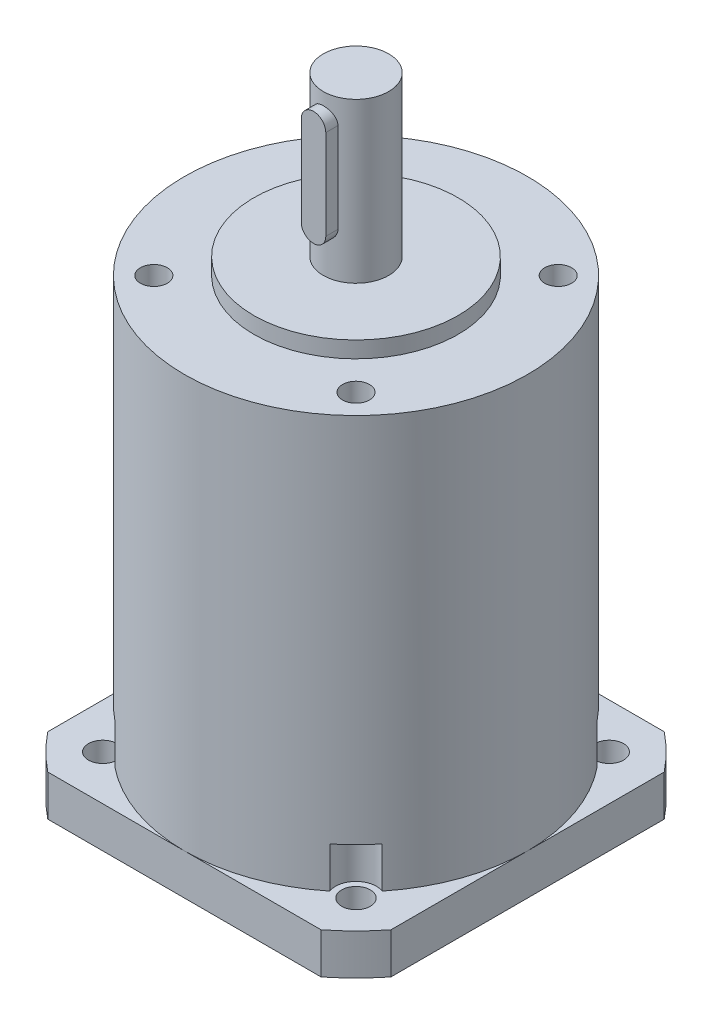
ISO-10303-21;
HEADER;
FILE_DESCRIPTION(('STEP AP214'),'2;1');
FILE_NAME('part.step','',(''),(''),'','','');
FILE_SCHEMA(('AUTOMOTIVE_DESIGN { 1 0 10303 214 1 1 1 1 }'));
ENDSEC;
DATA;
#1=APPLICATION_CONTEXT('core data for automotive mechanical design processes');
#2=APPLICATION_PROTOCOL_DEFINITION('international standard','automotive_design',2000,#1);
#3=PRODUCT_CONTEXT('',#1,'mechanical');
#4=PRODUCT('Part','Part','',(#3));
#5=PRODUCT_RELATED_PRODUCT_CATEGORY('part','',(#4));
#6=PRODUCT_DEFINITION_FORMATION('','',#4);
#7=PRODUCT_DEFINITION_CONTEXT('part definition',#1,'design');
#8=PRODUCT_DEFINITION('design','',#6,#7);
#9=PRODUCT_DEFINITION_SHAPE('','',#8);
#10=(LENGTH_UNIT() NAMED_UNIT(*) SI_UNIT(.MILLI.,.METRE.));
#11=(NAMED_UNIT(*) PLANE_ANGLE_UNIT() SI_UNIT($,.RADIAN.));
#12=(NAMED_UNIT(*) SI_UNIT($,.STERADIAN.) SOLID_ANGLE_UNIT());
#13=UNCERTAINTY_MEASURE_WITH_UNIT(LENGTH_MEASURE(1.E-05),#10,'distance_accuracy_value','');
#14=(GEOMETRIC_REPRESENTATION_CONTEXT(3) GLOBAL_UNCERTAINTY_ASSIGNED_CONTEXT((#13)) GLOBAL_UNIT_ASSIGNED_CONTEXT((#10,
#11,#12)) REPRESENTATION_CONTEXT('',''));
#15=CARTESIAN_POINT('',(0.,0.,0.));
#16=DIRECTION('',(0.,0.,1.));
#17=DIRECTION('',(1.,0.,0.));
#18=AXIS2_PLACEMENT_3D('',#15,#16,#17);
#19=CARTESIAN_POINT('',(0.,50.5,0.));
#20=DIRECTION('',(0.,-1.,0.));
#21=DIRECTION('',(0.,0.,-1.));
#22=AXIS2_PLACEMENT_3D('',#19,#20,#21);
#23=CYLINDRICAL_SURFACE('',#22,21.);
#24=CARTESIAN_POINT('',(0.,50.5,0.));
#25=DIRECTION('',(0.,1.,0.));
#26=DIRECTION('',(0.,0.,1.));
#27=AXIS2_PLACEMENT_3D('',#24,#25,#26);
#28=CIRCLE('',#27,21.);
#29=CARTESIAN_POINT('',(0.,50.5,21.));
#30=VERTEX_POINT('',#29);
#31=EDGE_CURVE('E235',#30,#30,#28,.T.);
#32=ORIENTED_EDGE('',*,*,#31,.F.);
#33=EDGE_LOOP('',(#32));
#34=FACE_BOUND('',#33,.T.);
#35=DIRECTION('',(0.,-1.,0.));
#36=VECTOR('',#35,1.);
#37=CARTESIAN_POINT('',(16.3684898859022,2.5,-13.1557036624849));
#38=LINE('',#37,#36);
#39=CARTESIAN_POINT('',(16.3684898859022,5.,-13.1557036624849));
#40=VERTEX_POINT('',#39);
#41=CARTESIAN_POINT('',(16.3684898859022,0.,-13.1557036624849));
#42=VERTEX_POINT('',#41);
#43=EDGE_CURVE('E199',#40,#42,#38,.T.);
#44=ORIENTED_EDGE('',*,*,#43,.F.);
#45=CARTESIAN_POINT('',(0.,5.,0.));
#46=DIRECTION('',(0.,-1.,0.));
#47=DIRECTION('',(0.,0.,-1.));
#48=AXIS2_PLACEMENT_3D('',#45,#46,#47);
#49=CIRCLE('',#48,21.);
#50=CARTESIAN_POINT('',(13.1557036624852,5.,-16.3684898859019));
#51=VERTEX_POINT('',#50);
#52=EDGE_CURVE('E314',#51,#40,#49,.T.);
#53=ORIENTED_EDGE('',*,*,#52,.F.);
#54=DIRECTION('',(0.,-1.,0.));
#55=VECTOR('',#54,1.);
#56=CARTESIAN_POINT('',(13.1557036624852,2.5,-16.3684898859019));
#57=LINE('',#56,#55);
#58=CARTESIAN_POINT('',(13.1557036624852,0.,-16.3684898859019));
#59=VERTEX_POINT('',#58);
#60=EDGE_CURVE('E210',#59,#51,#57,.F.);
#61=ORIENTED_EDGE('',*,*,#60,.F.);
#62=CARTESIAN_POINT('',(0.,0.,0.));
#63=DIRECTION('',(0.,1.,0.));
#64=DIRECTION('',(0.,0.,1.));
#65=AXIS2_PLACEMENT_3D('',#62,#63,#64);
#66=CIRCLE('',#65,21.);
#67=CARTESIAN_POINT('',(0.,0.,-21.));
#68=VERTEX_POINT('',#67);
#69=EDGE_CURVE('E220',#59,#68,#66,.T.);
#70=ORIENTED_EDGE('',*,*,#69,.T.);
#71=CARTESIAN_POINT('',(-13.155703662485,0.,-16.3684898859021));
#72=VERTEX_POINT('',#71);
#73=EDGE_CURVE('E228',#68,#72,#66,.T.);
#74=ORIENTED_EDGE('',*,*,#73,.T.);
#75=DIRECTION('',(0.,-1.,0.));
#76=VECTOR('',#75,1.);
#77=CARTESIAN_POINT('',(-13.155703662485,2.5,-16.3684898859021));
#78=LINE('',#77,#76);
#79=CARTESIAN_POINT('',(-13.155703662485,5.,-16.3684898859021));
#80=VERTEX_POINT('',#79);
#81=EDGE_CURVE('E606',#80,#72,#78,.T.);
#82=ORIENTED_EDGE('',*,*,#81,.F.);
#83=CARTESIAN_POINT('',(0.,5.,0.));
#84=DIRECTION('',(0.,-1.,0.));
#85=DIRECTION('',(0.,0.,-1.));
#86=AXIS2_PLACEMENT_3D('',#83,#84,#85);
#87=CIRCLE('',#86,21.);
#88=CARTESIAN_POINT('',(-16.3684898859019,5.,-13.1557036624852));
#89=VERTEX_POINT('',#88);
#90=EDGE_CURVE('E316',#89,#80,#87,.T.);
#91=ORIENTED_EDGE('',*,*,#90,.F.);
#92=DIRECTION('',(0.,-1.,0.));
#93=VECTOR('',#92,1.);
#94=CARTESIAN_POINT('',(-16.3684898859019,2.5,-13.1557036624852));
#95=LINE('',#94,#93);
#96=CARTESIAN_POINT('',(-16.3684898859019,0.,-13.1557036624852));
#97=VERTEX_POINT('',#96);
#98=EDGE_CURVE('E610',#97,#89,#95,.F.);
#99=ORIENTED_EDGE('',*,*,#98,.F.);
#100=CARTESIAN_POINT('',(-21.,0.,0.));
#101=VERTEX_POINT('',#100);
#102=EDGE_CURVE('E231',#97,#101,#66,.T.);
#103=ORIENTED_EDGE('',*,*,#102,.T.);
#104=CARTESIAN_POINT('',(-16.3684898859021,0.,13.155703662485));
#105=VERTEX_POINT('',#104);
#106=EDGE_CURVE('E229',#101,#105,#66,.T.);
#107=ORIENTED_EDGE('',*,*,#106,.T.);
#108=DIRECTION('',(0.,-1.,0.));
#109=VECTOR('',#108,1.);
#110=CARTESIAN_POINT('',(-16.3684898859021,2.5,13.155703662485));
#111=LINE('',#110,#109);
#112=CARTESIAN_POINT('',(-16.3684898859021,5.,13.155703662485));
#113=VERTEX_POINT('',#112);
#114=EDGE_CURVE('E331',#113,#105,#111,.T.);
#115=ORIENTED_EDGE('',*,*,#114,.F.);
#116=CARTESIAN_POINT('',(0.,5.,0.));
#117=DIRECTION('',(0.,-1.,0.));
#118=DIRECTION('',(0.,0.,-1.));
#119=AXIS2_PLACEMENT_3D('',#116,#117,#118);
#120=CIRCLE('',#119,21.);
#121=CARTESIAN_POINT('',(-13.1557036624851,5.,16.368489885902));
#122=VERTEX_POINT('',#121);
#123=EDGE_CURVE('E318',#122,#113,#120,.T.);
#124=ORIENTED_EDGE('',*,*,#123,.F.);
#125=DIRECTION('',(0.,-1.,0.));
#126=VECTOR('',#125,1.);
#127=CARTESIAN_POINT('',(-13.1557036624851,2.5,16.368489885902));
#128=LINE('',#127,#126);
#129=CARTESIAN_POINT('',(-13.1557036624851,0.,16.368489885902));
#130=VERTEX_POINT('',#129);
#131=EDGE_CURVE('E335',#130,#122,#128,.F.);
#132=ORIENTED_EDGE('',*,*,#131,.F.);
#133=CARTESIAN_POINT('',(0.,0.,21.));
#134=VERTEX_POINT('',#133);
#135=EDGE_CURVE('E230',#130,#134,#66,.T.);
#136=ORIENTED_EDGE('',*,*,#135,.T.);
#137=CARTESIAN_POINT('',(13.1557036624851,0.,16.368489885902));
#138=VERTEX_POINT('',#137);
#139=EDGE_CURVE('E227',#134,#138,#66,.T.);
#140=ORIENTED_EDGE('',*,*,#139,.T.);
#141=DIRECTION('',(0.,-1.,0.));
#142=VECTOR('',#141,1.);
#143=CARTESIAN_POINT('',(13.1557036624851,2.5,16.368489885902));
#144=LINE('',#143,#142);
#145=CARTESIAN_POINT('',(13.1557036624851,5.,16.368489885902));
#146=VERTEX_POINT('',#145);
#147=EDGE_CURVE('E46',#146,#138,#144,.T.);
#148=ORIENTED_EDGE('',*,*,#147,.F.);
#149=CARTESIAN_POINT('',(0.,5.,0.));
#150=DIRECTION('',(0.,-1.,0.));
#151=DIRECTION('',(0.,0.,-1.));
#152=AXIS2_PLACEMENT_3D('',#149,#150,#151);
#153=CIRCLE('',#152,21.);
#154=CARTESIAN_POINT('',(16.368489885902,5.,13.1557036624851));
#155=VERTEX_POINT('',#154);
#156=EDGE_CURVE('E307',#155,#146,#153,.T.);
#157=ORIENTED_EDGE('',*,*,#156,.F.);
#158=DIRECTION('',(0.,-1.,0.));
#159=VECTOR('',#158,1.);
#160=CARTESIAN_POINT('',(16.368489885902,2.5,13.1557036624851));
#161=LINE('',#160,#159);
#162=CARTESIAN_POINT('',(16.368489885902,0.,13.1557036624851));
#163=VERTEX_POINT('',#162);
#164=EDGE_CURVE('E11',#163,#155,#161,.F.);
#165=ORIENTED_EDGE('',*,*,#164,.F.);
#166=CARTESIAN_POINT('',(21.,0.,0.));
#167=VERTEX_POINT('',#166);
#168=EDGE_CURVE('E224',#163,#167,#66,.T.);
#169=ORIENTED_EDGE('',*,*,#168,.T.);
#170=EDGE_CURVE('E217',#167,#42,#66,.T.);
#171=ORIENTED_EDGE('',*,*,#170,.T.);
#172=EDGE_LOOP('',(#44,#53,#61,#70,#74,#82,#91,#99,#103,#107,#115,#124,#132,#136,#140,#148,#157,
#165,#169,#171));
#173=FACE_BOUND('',#172,.T.);
#174=ADVANCED_FACE('F39',(#34,#173),#23,.T.);
#175=CARTESIAN_POINT('',(15.4999999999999,5.,-15.5000000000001));
#176=DIRECTION('',(0.,-1.,0.));
#177=DIRECTION('',(0.,0.,-1.));
#178=AXIS2_PLACEMENT_3D('',#175,#176,#177);
#179=CYLINDRICAL_SURFACE('',#178,1.75);
#180=CARTESIAN_POINT('',(15.4999999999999,-5.,-15.5000000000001));
#181=DIRECTION('',(0.,-1.,0.));
#182=DIRECTION('',(0.,0.,-1.));
#183=AXIS2_PLACEMENT_3D('',#180,#181,#182);
#184=CIRCLE('',#183,1.75);
#185=CARTESIAN_POINT('',(15.4999999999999,-5.,-17.2500000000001));
#186=VERTEX_POINT('',#185);
#187=EDGE_CURVE('E349',#186,#186,#184,.T.);
#188=ORIENTED_EDGE('',*,*,#187,.T.);
#189=EDGE_LOOP('',(#188));
#190=FACE_BOUND('',#189,.T.);
#191=CARTESIAN_POINT('',(15.4999999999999,0.,-15.5000000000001));
#192=DIRECTION('',(0.,-1.,0.));
#193=DIRECTION('',(0.,0.,-1.));
#194=AXIS2_PLACEMENT_3D('',#191,#192,#193);
#195=CIRCLE('',#194,1.75);
#196=CARTESIAN_POINT('',(15.4999999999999,0.,-17.2500000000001));
#197=VERTEX_POINT('',#196);
#198=EDGE_CURVE('E352',#197,#197,#195,.T.);
#199=ORIENTED_EDGE('',*,*,#198,.F.);
#200=EDGE_LOOP('',(#199));
#201=FACE_BOUND('',#200,.T.);
#202=ADVANCED_FACE('F493',(#190,#201),#179,.F.);
#203=CARTESIAN_POINT('',(-15.5000000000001,5.,-15.4999999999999));
#204=DIRECTION('',(0.,-1.,0.));
#205=DIRECTION('',(0.,0.,-1.));
#206=AXIS2_PLACEMENT_3D('',#203,#204,#205);
#207=CYLINDRICAL_SURFACE('',#206,1.75);
#208=CARTESIAN_POINT('',(-15.5000000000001,-5.,-15.4999999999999));
#209=DIRECTION('',(0.,-1.,0.));
#210=DIRECTION('',(0.,0.,-1.));
#211=AXIS2_PLACEMENT_3D('',#208,#209,#210);
#212=CIRCLE('',#211,1.75);
#213=CARTESIAN_POINT('',(-15.5000000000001,-5.,-17.2499999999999));
#214=VERTEX_POINT('',#213);
#215=EDGE_CURVE('E343',#214,#214,#212,.T.);
#216=ORIENTED_EDGE('',*,*,#215,.T.);
#217=EDGE_LOOP('',(#216));
#218=FACE_BOUND('',#217,.T.);
#219=CARTESIAN_POINT('',(-15.5000000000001,0.,-15.4999999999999));
#220=DIRECTION('',(0.,-1.,0.));
#221=DIRECTION('',(0.,0.,-1.));
#222=AXIS2_PLACEMENT_3D('',#219,#220,#221);
#223=CIRCLE('',#222,1.75);
#224=CARTESIAN_POINT('',(-15.5000000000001,0.,-17.2499999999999));
#225=VERTEX_POINT('',#224);
#226=EDGE_CURVE('E346',#225,#225,#223,.T.);
#227=ORIENTED_EDGE('',*,*,#226,.F.);
#228=EDGE_LOOP('',(#227));
#229=FACE_BOUND('',#228,.T.);
#230=ADVANCED_FACE('F498',(#218,#229),#207,.F.);
#231=CARTESIAN_POINT('',(-15.4999999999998,5.,15.5000000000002));
#232=DIRECTION('',(0.,-1.,0.));
#233=DIRECTION('',(0.,0.,-1.));
#234=AXIS2_PLACEMENT_3D('',#231,#232,#233);
#235=CYLINDRICAL_SURFACE('',#234,1.75);
#236=CARTESIAN_POINT('',(-15.4999999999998,-5.,15.5000000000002));
#237=DIRECTION('',(0.,-1.,0.));
#238=DIRECTION('',(0.,0.,-1.));
#239=AXIS2_PLACEMENT_3D('',#236,#237,#238);
#240=CIRCLE('',#239,1.75);
#241=CARTESIAN_POINT('',(-15.4999999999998,-5.,13.7500000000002));
#242=VERTEX_POINT('',#241);
#243=EDGE_CURVE('E333',#242,#242,#240,.T.);
#244=ORIENTED_EDGE('',*,*,#243,.T.);
#245=EDGE_LOOP('',(#244));
#246=FACE_BOUND('',#245,.T.);
#247=CARTESIAN_POINT('',(-15.4999999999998,0.,15.5000000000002));
#248=DIRECTION('',(0.,-1.,0.));
#249=DIRECTION('',(0.,0.,-1.));
#250=AXIS2_PLACEMENT_3D('',#247,#248,#249);
#251=CIRCLE('',#250,1.75);
#252=CARTESIAN_POINT('',(-15.4999999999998,0.,13.7500000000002));
#253=VERTEX_POINT('',#252);
#254=EDGE_CURVE('E340',#253,#253,#251,.T.);
#255=ORIENTED_EDGE('',*,*,#254,.F.);
#256=EDGE_LOOP('',(#255));
#257=FACE_BOUND('',#256,.T.);
#258=ADVANCED_FACE('F504',(#246,#257),#235,.F.);
#259=CARTESIAN_POINT('',(15.5,5.,15.5));
#260=DIRECTION('',(0.,-1.,0.));
#261=DIRECTION('',(0.,0.,-1.));
#262=AXIS2_PLACEMENT_3D('',#259,#260,#261);
#263=CYLINDRICAL_SURFACE('',#262,1.75);
#264=CARTESIAN_POINT('',(15.5,-5.,15.5));
#265=DIRECTION('',(0.,-1.,0.));
#266=DIRECTION('',(0.,0.,-1.));
#267=AXIS2_PLACEMENT_3D('',#264,#265,#266);
#268=CIRCLE('',#267,1.75);
#269=CARTESIAN_POINT('',(15.5,-5.,13.75));
#270=VERTEX_POINT('',#269);
#271=EDGE_CURVE('E355',#270,#270,#268,.T.);
#272=ORIENTED_EDGE('',*,*,#271,.T.);
#273=EDGE_LOOP('',(#272));
#274=FACE_BOUND('',#273,.T.);
#275=CARTESIAN_POINT('',(15.5,0.,15.5));
#276=DIRECTION('',(0.,-1.,0.));
#277=DIRECTION('',(0.,0.,-1.));
#278=AXIS2_PLACEMENT_3D('',#275,#276,#277);
#279=CIRCLE('',#278,1.75);
#280=CARTESIAN_POINT('',(15.5,0.,13.75));
#281=VERTEX_POINT('',#280);
#282=EDGE_CURVE('E358',#281,#281,#279,.T.);
#283=ORIENTED_EDGE('',*,*,#282,.F.);
#284=EDGE_LOOP('',(#283));
#285=FACE_BOUND('',#284,.T.);
#286=ADVANCED_FACE('F516',(#274,#285),#263,.F.);
#287=CARTESIAN_POINT('',(0.,0.,0.));
#288=DIRECTION('',(0.,-1.,0.));
#289=DIRECTION('',(0.,0.,-1.));
#290=AXIS2_PLACEMENT_3D('',#287,#288,#289);
#291=PLANE('',#290);
#292=ORIENTED_EDGE('',*,*,#282,.T.);
#293=EDGE_LOOP('',(#292));
#294=FACE_BOUND('',#293,.T.);
#295=CARTESIAN_POINT('',(15.5,0.,15.5));
#296=DIRECTION('',(0.,1.,0.));
#297=DIRECTION('',(0.,0.,1.));
#298=AXIS2_PLACEMENT_3D('',#295,#296,#297);
#299=CIRCLE('',#298,2.5);
#300=EDGE_CURVE('E324',#163,#138,#299,.T.);
#301=ORIENTED_EDGE('',*,*,#300,.T.);
#302=ORIENTED_EDGE('',*,*,#139,.F.);
#303=DIRECTION('',(1.,0.,0.));
#304=VECTOR('',#303,1.);
#305=CARTESIAN_POINT('',(-21.,0.,21.));
#306=LINE('',#305,#304);
#307=CARTESIAN_POINT('',(16.7308846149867,0.,21.));
#308=VERTEX_POINT('',#307);
#309=EDGE_CURVE('E422',#134,#308,#306,.T.);
#310=ORIENTED_EDGE('',*,*,#309,.T.);
#311=CARTESIAN_POINT('',(0.,0.,0.));
#312=DIRECTION('',(0.,1.,0.));
#313=DIRECTION('',(0.,0.,1.));
#314=AXIS2_PLACEMENT_3D('',#311,#312,#313);
#315=CIRCLE('',#314,26.85);
#316=CARTESIAN_POINT('',(21.,0.,16.7308846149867));
#317=VERTEX_POINT('',#316);
#318=EDGE_CURVE('E369',#308,#317,#315,.T.);
#319=ORIENTED_EDGE('',*,*,#318,.T.);
#320=DIRECTION('',(0.,0.,-1.));
#321=VECTOR('',#320,1.);
#322=CARTESIAN_POINT('',(21.,0.,21.));
#323=LINE('',#322,#321);
#324=EDGE_CURVE('E413',#317,#167,#323,.T.);
#325=ORIENTED_EDGE('',*,*,#324,.T.);
#326=ORIENTED_EDGE('',*,*,#168,.F.);
#327=EDGE_LOOP('',(#301,#302,#310,#319,#325,#326));
#328=FACE_BOUND('',#327,.T.);
#329=ADVANCED_FACE('F329',(#294,#328),#291,.F.);
#330=ORIENTED_EDGE('',*,*,#198,.T.);
#331=EDGE_LOOP('',(#330));
#332=FACE_BOUND('',#331,.T.);
#333=CARTESIAN_POINT('',(15.5000000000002,0.,-15.4999999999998));
#334=DIRECTION('',(0.,1.,0.));
#335=DIRECTION('',(0.,0.,1.));
#336=AXIS2_PLACEMENT_3D('',#333,#334,#335);
#337=CIRCLE('',#336,2.5);
#338=EDGE_CURVE('E203',#59,#42,#337,.T.);
#339=ORIENTED_EDGE('',*,*,#338,.T.);
#340=ORIENTED_EDGE('',*,*,#170,.F.);
#341=CARTESIAN_POINT('',(21.,0.,-16.7308846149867));
#342=VERTEX_POINT('',#341);
#343=EDGE_CURVE('E398',#167,#342,#323,.T.);
#344=ORIENTED_EDGE('',*,*,#343,.T.);
#345=CARTESIAN_POINT('',(16.7308846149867,0.,-21.));
#346=VERTEX_POINT('',#345);
#347=EDGE_CURVE('E373',#342,#346,#315,.T.);
#348=ORIENTED_EDGE('',*,*,#347,.T.);
#349=DIRECTION('',(-1.,0.,0.));
#350=VECTOR('',#349,1.);
#351=CARTESIAN_POINT('',(-21.,0.,-21.));
#352=LINE('',#351,#350);
#353=EDGE_CURVE('E416',#346,#68,#352,.T.);
#354=ORIENTED_EDGE('',*,*,#353,.T.);
#355=ORIENTED_EDGE('',*,*,#69,.F.);
#356=EDGE_LOOP('',(#339,#340,#344,#348,#354,#355));
#357=FACE_BOUND('',#356,.T.);
#358=ADVANCED_FACE('F215',(#332,#357),#291,.F.);
#359=ORIENTED_EDGE('',*,*,#226,.T.);
#360=EDGE_LOOP('',(#359));
#361=FACE_BOUND('',#360,.T.);
#362=CARTESIAN_POINT('',(-15.4999999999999,0.,-15.5000000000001));
#363=DIRECTION('',(0.,1.,0.));
#364=DIRECTION('',(0.,0.,1.));
#365=AXIS2_PLACEMENT_3D('',#362,#363,#364);
#366=CIRCLE('',#365,2.5);
#367=EDGE_CURVE('E209',#97,#72,#366,.T.);
#368=ORIENTED_EDGE('',*,*,#367,.T.);
#369=ORIENTED_EDGE('',*,*,#73,.F.);
#370=CARTESIAN_POINT('',(-16.7308846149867,0.,-21.));
#371=VERTEX_POINT('',#370);
#372=EDGE_CURVE('E415',#68,#371,#352,.T.);
#373=ORIENTED_EDGE('',*,*,#372,.T.);
#374=CARTESIAN_POINT('',(-21.,0.,-16.7308846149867));
#375=VERTEX_POINT('',#374);
#376=EDGE_CURVE('E366',#371,#375,#315,.T.);
#377=ORIENTED_EDGE('',*,*,#376,.T.);
#378=DIRECTION('',(0.,0.,1.));
#379=VECTOR('',#378,1.);
#380=CARTESIAN_POINT('',(-21.,0.,21.));
#381=LINE('',#380,#379);
#382=EDGE_CURVE('E419',#375,#101,#381,.T.);
#383=ORIENTED_EDGE('',*,*,#382,.T.);
#384=ORIENTED_EDGE('',*,*,#102,.F.);
#385=EDGE_LOOP('',(#368,#369,#373,#377,#383,#384));
#386=FACE_BOUND('',#385,.T.);
#387=ADVANCED_FACE('F561',(#361,#386),#291,.F.);
#388=CARTESIAN_POINT('',(21.,-5.,21.));
#389=DIRECTION('',(1.,0.,0.));
#390=DIRECTION('',(0.,0.,-1.));
#391=AXIS2_PLACEMENT_3D('',#388,#389,#390);
#392=PLANE('',#391);
#393=DIRECTION('',(0.,0.,-1.));
#394=VECTOR('',#393,1.);
#395=CARTESIAN_POINT('',(21.,-5.,21.));
#396=LINE('',#395,#394);
#397=CARTESIAN_POINT('',(21.,-5.,16.7308846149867));
#398=VERTEX_POINT('',#397);
#399=CARTESIAN_POINT('',(21.,-5.,-16.7308846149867));
#400=VERTEX_POINT('',#399);
#401=EDGE_CURVE('E399',#398,#400,#396,.T.);
#402=ORIENTED_EDGE('',*,*,#401,.T.);
#403=DIRECTION('',(0.,1.,0.));
#404=VECTOR('',#403,1.);
#405=CARTESIAN_POINT('',(21.,-5.5,-16.7308846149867));
#406=LINE('',#405,#404);
#407=EDGE_CURVE('E395',#400,#342,#406,.T.);
#408=ORIENTED_EDGE('',*,*,#407,.T.);
#409=ORIENTED_EDGE('',*,*,#343,.F.);
#410=ORIENTED_EDGE('',*,*,#324,.F.);
#411=DIRECTION('',(0.,1.,0.));
#412=VECTOR('',#411,1.);
#413=CARTESIAN_POINT('',(21.,-5.5,16.7308846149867));
#414=LINE('',#413,#412);
#415=EDGE_CURVE('E389',#317,#398,#414,.F.);
#416=ORIENTED_EDGE('',*,*,#415,.T.);
#417=EDGE_LOOP('',(#402,#408,#409,#410,#416));
#418=FACE_BOUND('',#417,.T.);
#419=ADVANCED_FACE('F552',(#418),#392,.T.);
#420=CARTESIAN_POINT('',(-21.,-5.,21.));
#421=DIRECTION('',(0.,0.,1.));
#422=DIRECTION('',(1.,0.,0.));
#423=AXIS2_PLACEMENT_3D('',#420,#421,#422);
#424=PLANE('',#423);
#425=DIRECTION('',(1.,0.,0.));
#426=VECTOR('',#425,1.);
#427=CARTESIAN_POINT('',(-21.,-5.,21.));
#428=LINE('',#427,#426);
#429=CARTESIAN_POINT('',(-16.7308846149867,-5.,21.));
#430=VERTEX_POINT('',#429);
#431=CARTESIAN_POINT('',(16.7308846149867,-5.,21.));
#432=VERTEX_POINT('',#431);
#433=EDGE_CURVE('E409',#430,#432,#428,.T.);
#434=ORIENTED_EDGE('',*,*,#433,.T.);
#435=DIRECTION('',(0.,1.,0.));
#436=VECTOR('',#435,1.);
#437=CARTESIAN_POINT('',(16.7308846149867,-5.5,21.));
#438=LINE('',#437,#436);
#439=EDGE_CURVE('E61',#432,#308,#438,.T.);
#440=ORIENTED_EDGE('',*,*,#439,.T.);
#441=ORIENTED_EDGE('',*,*,#309,.F.);
#442=CARTESIAN_POINT('',(-16.7308846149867,0.,21.));
#443=VERTEX_POINT('',#442);
#444=EDGE_CURVE('E403',#443,#134,#306,.T.);
#445=ORIENTED_EDGE('',*,*,#444,.F.);
#446=DIRECTION('',(0.,1.,0.));
#447=VECTOR('',#446,1.);
#448=CARTESIAN_POINT('',(-16.7308846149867,-5.5,21.));
#449=LINE('',#448,#447);
#450=EDGE_CURVE('E384',#443,#430,#449,.F.);
#451=ORIENTED_EDGE('',*,*,#450,.T.);
#452=EDGE_LOOP('',(#434,#440,#441,#445,#451));
#453=FACE_BOUND('',#452,.T.);
#454=ADVANCED_FACE('F548',(#453),#424,.T.);
#455=CARTESIAN_POINT('',(-21.,-5.,21.));
#456=DIRECTION('',(-1.,0.,0.));
#457=DIRECTION('',(0.,0.,1.));
#458=AXIS2_PLACEMENT_3D('',#455,#456,#457);
#459=PLANE('',#458);
#460=DIRECTION('',(0.,0.,1.));
#461=VECTOR('',#460,1.);
#462=CARTESIAN_POINT('',(-21.,-5.,21.));
#463=LINE('',#462,#461);
#464=CARTESIAN_POINT('',(-21.,-5.,-16.7308846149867));
#465=VERTEX_POINT('',#464);
#466=CARTESIAN_POINT('',(-21.,-5.,16.7308846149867));
#467=VERTEX_POINT('',#466);
#468=EDGE_CURVE('E406',#465,#467,#463,.T.);
#469=ORIENTED_EDGE('',*,*,#468,.T.);
#470=DIRECTION('',(0.,1.,0.));
#471=VECTOR('',#470,1.);
#472=CARTESIAN_POINT('',(-21.,-5.5,16.7308846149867));
#473=LINE('',#472,#471);
#474=CARTESIAN_POINT('',(-21.,0.,16.7308846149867));
#475=VERTEX_POINT('',#474);
#476=EDGE_CURVE('E381',#467,#475,#473,.T.);
#477=ORIENTED_EDGE('',*,*,#476,.T.);
#478=EDGE_CURVE('E418',#101,#475,#381,.T.);
#479=ORIENTED_EDGE('',*,*,#478,.F.);
#480=ORIENTED_EDGE('',*,*,#382,.F.);
#481=DIRECTION('',(0.,1.,0.));
#482=VECTOR('',#481,1.);
#483=CARTESIAN_POINT('',(-21.,-5.5,-16.7308846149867));
#484=LINE('',#483,#482);
#485=EDGE_CURVE('E378',#375,#465,#484,.F.);
#486=ORIENTED_EDGE('',*,*,#485,.T.);
#487=EDGE_LOOP('',(#469,#477,#479,#480,#486));
#488=FACE_BOUND('',#487,.T.);
#489=ADVANCED_FACE('F551',(#488),#459,.T.);
#490=CARTESIAN_POINT('',(-21.,-5.,-21.));
#491=DIRECTION('',(0.,0.,-1.));
#492=DIRECTION('',(-1.,0.,0.));
#493=AXIS2_PLACEMENT_3D('',#490,#491,#492);
#494=PLANE('',#493);
#495=DIRECTION('',(-1.,0.,0.));
#496=VECTOR('',#495,1.);
#497=CARTESIAN_POINT('',(-21.,-5.,-21.));
#498=LINE('',#497,#496);
#499=CARTESIAN_POINT('',(16.7308846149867,-5.,-21.));
#500=VERTEX_POINT('',#499);
#501=CARTESIAN_POINT('',(-16.7308846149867,-5.,-21.));
#502=VERTEX_POINT('',#501);
#503=EDGE_CURVE('E402',#500,#502,#498,.T.);
#504=ORIENTED_EDGE('',*,*,#503,.T.);
#505=DIRECTION('',(0.,1.,0.));
#506=VECTOR('',#505,1.);
#507=CARTESIAN_POINT('',(-16.7308846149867,-5.5,-21.));
#508=LINE('',#507,#506);
#509=EDGE_CURVE('E53',#502,#371,#508,.T.);
#510=ORIENTED_EDGE('',*,*,#509,.T.);
#511=ORIENTED_EDGE('',*,*,#372,.F.);
#512=ORIENTED_EDGE('',*,*,#353,.F.);
#513=DIRECTION('',(0.,1.,0.));
#514=VECTOR('',#513,1.);
#515=CARTESIAN_POINT('',(16.7308846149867,-5.5,-21.));
#516=LINE('',#515,#514);
#517=EDGE_CURVE('E392',#346,#500,#516,.F.);
#518=ORIENTED_EDGE('',*,*,#517,.T.);
#519=EDGE_LOOP('',(#504,#510,#511,#512,#518));
#520=FACE_BOUND('',#519,.T.);
#521=ADVANCED_FACE('F543',(#520),#494,.T.);
#522=CARTESIAN_POINT('',(0.,-5.,0.));
#523=DIRECTION('',(0.,-1.,0.));
#524=DIRECTION('',(0.,0.,-1.));
#525=AXIS2_PLACEMENT_3D('',#522,#523,#524);
#526=PLANE('',#525);
#527=ORIENTED_EDGE('',*,*,#243,.F.);
#528=EDGE_LOOP('',(#527));
#529=FACE_BOUND('',#528,.T.);
#530=ORIENTED_EDGE('',*,*,#215,.F.);
#531=EDGE_LOOP('',(#530));
#532=FACE_BOUND('',#531,.T.);
#533=ORIENTED_EDGE('',*,*,#187,.F.);
#534=EDGE_LOOP('',(#533));
#535=FACE_BOUND('',#534,.T.);
#536=ORIENTED_EDGE('',*,*,#271,.F.);
#537=EDGE_LOOP('',(#536));
#538=FACE_BOUND('',#537,.T.);
#539=CARTESIAN_POINT('',(0.,-5.,0.));
#540=DIRECTION('',(0.,-1.,0.));
#541=DIRECTION('',(0.,0.,-1.));
#542=AXIS2_PLACEMENT_3D('',#539,#540,#541);
#543=CIRCLE('',#542,11.);
#544=CARTESIAN_POINT('',(0.,-5.,-11.));
#545=VERTEX_POINT('',#544);
#546=EDGE_CURVE('E311',#545,#545,#543,.T.);
#547=ORIENTED_EDGE('',*,*,#546,.F.);
#548=EDGE_LOOP('',(#547));
#549=FACE_BOUND('',#548,.T.);
#550=ORIENTED_EDGE('',*,*,#503,.F.);
#551=CARTESIAN_POINT('',(0.,-5.,0.));
#552=DIRECTION('',(0.,-1.,0.));
#553=DIRECTION('',(0.,0.,-1.));
#554=AXIS2_PLACEMENT_3D('',#551,#552,#553);
#555=CIRCLE('',#554,26.85);
#556=EDGE_CURVE('E375',#500,#400,#555,.T.);
#557=ORIENTED_EDGE('',*,*,#556,.T.);
#558=ORIENTED_EDGE('',*,*,#401,.F.);
#559=EDGE_CURVE('E387',#398,#432,#555,.T.);
#560=ORIENTED_EDGE('',*,*,#559,.T.);
#561=ORIENTED_EDGE('',*,*,#433,.F.);
#562=EDGE_CURVE('E376',#430,#467,#555,.T.);
#563=ORIENTED_EDGE('',*,*,#562,.T.);
#564=ORIENTED_EDGE('',*,*,#468,.F.);
#565=EDGE_CURVE('E372',#465,#502,#555,.T.);
#566=ORIENTED_EDGE('',*,*,#565,.T.);
#567=EDGE_LOOP('',(#550,#557,#558,#560,#561,#563,#564,#566));
#568=FACE_BOUND('',#567,.T.);
#569=ADVANCED_FACE('F540',(#529,#532,#535,#538,#549,#568),#526,.T.);
#570=ORIENTED_EDGE('',*,*,#254,.T.);
#571=EDGE_LOOP('',(#570));
#572=FACE_BOUND('',#571,.T.);
#573=CARTESIAN_POINT('',(-15.5000000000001,0.,15.4999999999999));
#574=DIRECTION('',(0.,1.,0.));
#575=DIRECTION('',(0.,0.,1.));
#576=AXIS2_PLACEMENT_3D('',#573,#574,#575);
#577=CIRCLE('',#576,2.5);
#578=EDGE_CURVE('E602',#130,#105,#577,.T.);
#579=ORIENTED_EDGE('',*,*,#578,.T.);
#580=ORIENTED_EDGE('',*,*,#106,.F.);
#581=ORIENTED_EDGE('',*,*,#478,.T.);
#582=CARTESIAN_POINT('',(0.,0.,0.));
#583=DIRECTION('',(0.,-1.,0.));
#584=DIRECTION('',(0.,0.,-1.));
#585=AXIS2_PLACEMENT_3D('',#582,#583,#584);
#586=CIRCLE('',#585,26.85);
#587=EDGE_CURVE('E305',#443,#475,#586,.T.);
#588=ORIENTED_EDGE('',*,*,#587,.F.);
#589=ORIENTED_EDGE('',*,*,#444,.T.);
#590=ORIENTED_EDGE('',*,*,#135,.F.);
#591=EDGE_LOOP('',(#579,#580,#581,#588,#589,#590));
#592=FACE_BOUND('',#591,.T.);
#593=ADVANCED_FACE('F476',(#572,#592),#291,.F.);
#594=CARTESIAN_POINT('',(0.,72.,0.));
#595=DIRECTION('',(0.,-1.,0.));
#596=DIRECTION('',(0.,0.,-1.));
#597=AXIS2_PLACEMENT_3D('',#594,#595,#596);
#598=CYLINDRICAL_SURFACE('',#597,4.);
#599=CARTESIAN_POINT('',(0.,72.,0.));
#600=DIRECTION('',(0.,1.,0.));
#601=DIRECTION('',(0.,0.,1.));
#602=AXIS2_PLACEMENT_3D('',#599,#600,#601);
#603=CIRCLE('',#602,4.);
#604=CARTESIAN_POINT('',(0.,72.,4.));
#605=VERTEX_POINT('',#604);
#606=EDGE_CURVE('E255',#605,#605,#603,.T.);
#607=ORIENTED_EDGE('',*,*,#606,.F.);
#608=EDGE_LOOP('',(#607));
#609=FACE_BOUND('',#608,.T.);
#610=CARTESIAN_POINT('',(0.,52.5,0.));
#611=DIRECTION('',(0.,1.,0.));
#612=DIRECTION('',(0.,0.,1.));
#613=AXIS2_PLACEMENT_3D('',#610,#611,#612);
#614=CIRCLE('',#613,4.);
#615=CARTESIAN_POINT('',(0.,52.5,4.));
#616=VERTEX_POINT('',#615);
#617=EDGE_CURVE('E252',#616,#616,#614,.F.);
#618=ORIENTED_EDGE('',*,*,#617,.F.);
#619=EDGE_LOOP('',(#618));
#620=FACE_BOUND('',#619,.T.);
#621=CARTESIAN_POINT('',(-1.5,58.,3.70809924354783));
#622=CARTESIAN_POINT('',(-1.50000304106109,57.9189925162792,3.70809640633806));
#623=CARTESIAN_POINT('',(-1.49341597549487,57.8380050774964,3.71078260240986));
#624=CARTESIAN_POINT('',(-1.46736187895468,57.6784719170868,3.72116159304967));
#625=CARTESIAN_POINT('',(-1.44789523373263,57.599926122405,3.72885423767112));
#626=CARTESIAN_POINT('',(-1.39689657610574,57.4476246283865,3.748254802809));
#627=CARTESIAN_POINT('',(-1.36539347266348,57.3738579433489,3.7599530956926));
#628=CARTESIAN_POINT('',(-1.29131856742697,57.2326281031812,3.78603134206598));
#629=CARTESIAN_POINT('',(-1.24874344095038,57.1651668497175,3.80041210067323));
#630=CARTESIAN_POINT('',(-1.15146661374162,57.0351096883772,3.83103574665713));
#631=CARTESIAN_POINT('',(-1.09630381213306,56.9728714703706,3.84733341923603));
#632=CARTESIAN_POINT('',(-0.976395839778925,56.8582771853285,3.87949750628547));
#633=CARTESIAN_POINT('',(-0.91164863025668,56.8059232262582,3.89536382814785));
#634=CARTESIAN_POINT('',(-0.771694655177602,56.7108604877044,3.92552873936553));
#635=CARTESIAN_POINT('',(-0.69620694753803,56.6685405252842,3.93975561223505));
#636=CARTESIAN_POINT('',(-0.538555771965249,56.5973488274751,3.96438007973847));
#637=CARTESIAN_POINT('',(-0.456394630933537,56.568472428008,3.97477900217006));
#638=CARTESIAN_POINT('',(-0.291489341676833,56.5262421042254,3.99018697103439));
#639=CARTESIAN_POINT('',(-0.208923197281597,56.5122723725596,3.99540915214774));
#640=CARTESIAN_POINT('',(-0.042464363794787,56.498278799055,4.0006401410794));
#641=CARTESIAN_POINT('',(0.0414278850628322,56.4982504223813,4.00065064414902));
#642=CARTESIAN_POINT('',(0.203743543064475,56.5117817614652,3.99559265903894));
#643=CARTESIAN_POINT('',(0.282232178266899,56.5246692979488,3.99077541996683));
#644=CARTESIAN_POINT('',(0.435839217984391,56.5625359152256,3.97693274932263));
#645=CARTESIAN_POINT('',(0.510957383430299,56.5875158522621,3.96790701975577));
#646=CARTESIAN_POINT('',(0.656989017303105,56.6491704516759,3.9463776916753));
#647=CARTESIAN_POINT('',(0.727825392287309,56.6860100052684,3.93382539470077));
#648=CARTESIAN_POINT('',(0.862486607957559,56.7701920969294,3.90651310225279));
#649=CARTESIAN_POINT('',(0.926309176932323,56.8175380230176,3.8917523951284));
#650=CARTESIAN_POINT('',(1.04909048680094,56.9246272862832,3.86052529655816));
#651=CARTESIAN_POINT('',(1.10754614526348,56.9849339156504,3.84400963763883));
#652=CARTESIAN_POINT('',(1.21370395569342,57.1145929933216,3.81182460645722));
#653=CARTESIAN_POINT('',(1.261403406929,57.1839477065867,3.79615544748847));
#654=CARTESIAN_POINT('',(1.34565611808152,57.3317194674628,3.76712703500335));
#655=CARTESIAN_POINT('',(1.38193847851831,57.4103034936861,3.75382677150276));
#656=CARTESIAN_POINT('',(1.44056464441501,57.5730962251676,3.73172438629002));
#657=CARTESIAN_POINT('',(1.46291620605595,57.6573017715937,3.72291976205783));
#658=CARTESIAN_POINT('',(1.49190191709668,57.823975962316,3.71139597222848));
#659=CARTESIAN_POINT('',(1.49933521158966,57.9062841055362,3.70836785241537));
#660=CARTESIAN_POINT('',(1.50057885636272,58.0710093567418,3.70786539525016));
#661=CARTESIAN_POINT('',(1.49439261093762,58.1534264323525,3.71038967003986));
#662=CARTESIAN_POINT('',(1.46929733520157,58.3119299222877,3.72039381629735));
#663=CARTESIAN_POINT('',(1.45100618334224,58.3881311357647,3.72763276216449));
#664=CARTESIAN_POINT('',(1.40299774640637,58.5363479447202,3.74596487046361));
#665=CARTESIAN_POINT('',(1.37327812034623,58.6083626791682,3.75705882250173));
#666=CARTESIAN_POINT('',(1.30200292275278,58.7491644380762,3.78236243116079));
#667=CARTESIAN_POINT('',(1.26004545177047,58.8177292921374,3.79667328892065));
#668=CARTESIAN_POINT('',(1.16591317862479,58.9471289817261,3.82662814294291));
#669=CARTESIAN_POINT('',(1.11373463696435,59.0079609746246,3.84227262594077));
#670=CARTESIAN_POINT('',(0.996727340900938,59.1241683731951,3.87433046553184));
#671=CARTESIAN_POINT('',(0.93130634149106,59.1789534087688,3.89072969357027));
#672=CARTESIAN_POINT('',(0.79179747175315,59.2768383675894,3.92149874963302));
#673=CARTESIAN_POINT('',(0.717709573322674,59.3199382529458,3.93586857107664));
#674=CARTESIAN_POINT('',(0.563016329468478,59.3929460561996,3.96094985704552));
#675=CARTESIAN_POINT('',(0.482434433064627,59.4228991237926,3.9716738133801));
#676=CARTESIAN_POINT('',(0.316881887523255,59.4686564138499,3.98829436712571));
#677=CARTESIAN_POINT('',(0.231913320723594,59.4844672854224,3.99419323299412));
#678=CARTESIAN_POINT('',(0.0653355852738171,59.5007744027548,4.00028407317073));
#679=CARTESIAN_POINT('',(-0.0161807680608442,59.502109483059,4.00078860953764));
#680=CARTESIAN_POINT('',(-0.178226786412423,59.4915848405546,3.99684889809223));
#681=CARTESIAN_POINT('',(-0.258756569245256,59.4797267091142,3.9924052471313));
#682=CARTESIAN_POINT('',(-0.414548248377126,59.4437411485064,3.97921089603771));
#683=CARTESIAN_POINT('',(-0.489890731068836,59.4199200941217,3.97056791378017));
#684=CARTESIAN_POINT('',(-0.635515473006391,59.3609899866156,3.9498778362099));
#685=CARTESIAN_POINT('',(-0.705796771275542,59.3258787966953,3.93783009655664));
#686=CARTESIAN_POINT('',(-0.84254017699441,59.2436860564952,3.91090618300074));
#687=CARTESIAN_POINT('',(-0.908717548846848,59.1961633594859,3.89593240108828));
#688=CARTESIAN_POINT('',(-1.03241734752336,59.0911921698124,3.86499507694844));
#689=CARTESIAN_POINT('',(-1.0899366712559,59.0337401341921,3.84903118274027));
#690=CARTESIAN_POINT('',(-1.19781214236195,58.9069358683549,3.81688129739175));
#691=CARTESIAN_POINT('',(-1.24762999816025,58.8371155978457,3.8007280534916));
#692=CARTESIAN_POINT('',(-1.33484709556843,58.6895841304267,3.77098325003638));
#693=CARTESIAN_POINT('',(-1.37224504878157,58.6118721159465,3.75739195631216));
#694=CARTESIAN_POINT('',(-1.43465886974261,58.4470443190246,3.73402269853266));
#695=CARTESIAN_POINT('',(-1.45906002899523,58.3596656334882,3.7244380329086));
#696=CARTESIAN_POINT('',(-1.49172356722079,58.1815147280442,3.71147994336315));
#697=CARTESIAN_POINT('',(-1.4999965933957,58.09074478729,3.70810242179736));
#698=CARTESIAN_POINT('',(-1.5,58.,3.70809924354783));
#699=B_SPLINE_CURVE_WITH_KNOTS('',3,(#621,#622,#623,#624,#625,#626,#627,#628,#629,#630,#631,
#632,#633,#634,#635,#636,#637,#638,#639,#640,#641,#642,#643,#644,#645,#646,#647,#648,#649,#650,
#651,#652,#653,#654,#655,#656,#657,#658,#659,#660,#661,#662,#663,#664,#665,#666,#667,#668,#669,
#670,#671,#672,#673,#674,#675,#676,#677,#678,#679,#680,#681,#682,#683,#684,#685,#686,#687,#688,
#689,#690,#691,#692,#693,#694,#695,#696,#697,#698),.UNSPECIFIED.,.T.,.F.,(4,2,2,2,2,2,2,2,2,2,2,
2,2,2,2,2,2,2,2,2,2,2,2,2,2,2,2,2,2,2,2,2,2,2,2,2,2,2,4),(0.,0.242684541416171,
0.485361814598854,0.727459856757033,0.969630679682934,1.22274652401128,1.47591628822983,
1.73770072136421,1.9993942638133,2.24980018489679,2.50012465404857,2.73806472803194,
2.97602165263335,3.21744131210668,3.45893893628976,3.71456675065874,3.97025867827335,
4.23162592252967,4.49284751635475,4.73965657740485,4.98640395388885,5.22143845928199,
5.45652113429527,5.70041561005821,5.94439948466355,6.20385016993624,6.46330169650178,
6.72185508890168,6.98028685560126,7.22365720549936,7.46699820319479,7.70440274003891,
7.94185223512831,8.18928323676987,8.43680270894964,8.6973859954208,8.95799630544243,
9.23003178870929,9.50188762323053),.UNSPECIFIED.);
#700=CARTESIAN_POINT('',(-1.5,58.,3.70809924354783));
#701=VERTEX_POINT('',#700);
#702=CARTESIAN_POINT('',(1.5,58.,3.70809924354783));
#703=VERTEX_POINT('',#702);
#704=EDGE_CURVE('E300',#701,#703,#699,.T.);
#705=ORIENTED_EDGE('',*,*,#704,.F.);
#706=DIRECTION('',(0.,-1.,0.));
#707=VECTOR('',#706,1.);
#708=CARTESIAN_POINT('',(-1.5,72.,3.70809924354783));
#709=LINE('',#708,#707);
#710=CARTESIAN_POINT('',(-1.5,69.,3.70809924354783));
#711=VERTEX_POINT('',#710);
#712=EDGE_CURVE('E258',#711,#701,#709,.T.);
#713=ORIENTED_EDGE('',*,*,#712,.F.);
#714=CARTESIAN_POINT('',(-1.5,69.,3.70809924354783));
#715=CARTESIAN_POINT('',(-1.50000304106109,68.9189925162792,3.70809640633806));
#716=CARTESIAN_POINT('',(-1.49341597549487,68.8380050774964,3.71078260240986));
#717=CARTESIAN_POINT('',(-1.46736187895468,68.6784719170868,3.72116159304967));
#718=CARTESIAN_POINT('',(-1.44789523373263,68.599926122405,3.72885423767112));
#719=CARTESIAN_POINT('',(-1.39689657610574,68.4476246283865,3.748254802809));
#720=CARTESIAN_POINT('',(-1.36539347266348,68.3738579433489,3.7599530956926));
#721=CARTESIAN_POINT('',(-1.29131856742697,68.2326281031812,3.78603134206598));
#722=CARTESIAN_POINT('',(-1.24874344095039,68.1651668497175,3.80041210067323));
#723=CARTESIAN_POINT('',(-1.15146661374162,68.0351096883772,3.83103574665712));
#724=CARTESIAN_POINT('',(-1.09630381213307,67.9728714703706,3.84733341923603));
#725=CARTESIAN_POINT('',(-0.976395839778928,67.8582771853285,3.87949750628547));
#726=CARTESIAN_POINT('',(-0.911648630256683,67.8059232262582,3.89536382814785));
#727=CARTESIAN_POINT('',(-0.771694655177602,67.7108604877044,3.92552873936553));
#728=CARTESIAN_POINT('',(-0.696206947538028,67.6685405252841,3.93975561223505));
#729=CARTESIAN_POINT('',(-0.538555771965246,67.5973488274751,3.96438007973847));
#730=CARTESIAN_POINT('',(-0.456394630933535,67.568472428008,3.97477900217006));
#731=CARTESIAN_POINT('',(-0.291489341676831,67.5262421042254,3.99018697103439));
#732=CARTESIAN_POINT('',(-0.208923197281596,67.5122723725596,3.99540915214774));
#733=CARTESIAN_POINT('',(-0.0424643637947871,67.498278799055,4.0006401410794));
#734=CARTESIAN_POINT('',(0.041427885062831,67.4982504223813,4.00065064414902));
#735=CARTESIAN_POINT('',(0.203743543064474,67.5117817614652,3.99559265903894));
#736=CARTESIAN_POINT('',(0.282232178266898,67.5246692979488,3.99077541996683));
#737=CARTESIAN_POINT('',(0.43583921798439,67.5625359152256,3.97693274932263));
#738=CARTESIAN_POINT('',(0.510957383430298,67.587515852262,3.96790701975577));
#739=CARTESIAN_POINT('',(0.656989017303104,67.6491704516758,3.9463776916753));
#740=CARTESIAN_POINT('',(0.727825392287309,67.6860100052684,3.93382539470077));
#741=CARTESIAN_POINT('',(0.862486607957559,67.7701920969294,3.90651310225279));
#742=CARTESIAN_POINT('',(0.926309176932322,67.8175380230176,3.8917523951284));
#743=CARTESIAN_POINT('',(1.04909048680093,67.9246272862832,3.86052529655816));
#744=CARTESIAN_POINT('',(1.10754614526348,67.9849339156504,3.84400963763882));
#745=CARTESIAN_POINT('',(1.21370395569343,68.1145929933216,3.81182460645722));
#746=CARTESIAN_POINT('',(1.261403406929,68.1839477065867,3.79615544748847));
#747=CARTESIAN_POINT('',(1.34565611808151,68.3317194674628,3.76712703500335));
#748=CARTESIAN_POINT('',(1.38193847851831,68.4103034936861,3.75382677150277));
#749=CARTESIAN_POINT('',(1.44056464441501,68.5730962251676,3.73172438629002));
#750=CARTESIAN_POINT('',(1.46291620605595,68.6573017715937,3.72291976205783));
#751=CARTESIAN_POINT('',(1.49190191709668,68.823975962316,3.71139597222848));
#752=CARTESIAN_POINT('',(1.49933521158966,68.9062841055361,3.70836785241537));
#753=CARTESIAN_POINT('',(1.50057885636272,69.0710093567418,3.70786539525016));
#754=CARTESIAN_POINT('',(1.49439261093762,69.1534264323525,3.71038967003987));
#755=CARTESIAN_POINT('',(1.46929733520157,69.3119299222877,3.72039381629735));
#756=CARTESIAN_POINT('',(1.45100618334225,69.3881311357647,3.72763276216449));
#757=CARTESIAN_POINT('',(1.40299774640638,69.5363479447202,3.74596487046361));
#758=CARTESIAN_POINT('',(1.37327812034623,69.6083626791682,3.75705882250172));
#759=CARTESIAN_POINT('',(1.30200292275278,69.7491644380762,3.78236243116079));
#760=CARTESIAN_POINT('',(1.26004545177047,69.8177292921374,3.79667328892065));
#761=CARTESIAN_POINT('',(1.16591317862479,69.947128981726,3.82662814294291));
#762=CARTESIAN_POINT('',(1.11373463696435,70.0079609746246,3.84227262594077));
#763=CARTESIAN_POINT('',(0.99672734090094,70.1241683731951,3.87433046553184));
#764=CARTESIAN_POINT('',(0.931306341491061,70.1789534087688,3.89072969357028));
#765=CARTESIAN_POINT('',(0.791797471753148,70.2768383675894,3.92149874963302));
#766=CARTESIAN_POINT('',(0.717709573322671,70.3199382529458,3.93586857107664));
#767=CARTESIAN_POINT('',(0.563016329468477,70.3929460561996,3.96094985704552));
#768=CARTESIAN_POINT('',(0.482434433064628,70.4228991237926,3.9716738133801));
#769=CARTESIAN_POINT('',(0.316881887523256,70.4686564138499,3.98829436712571));
#770=CARTESIAN_POINT('',(0.231913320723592,70.4844672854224,3.99419323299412));
#771=CARTESIAN_POINT('',(0.0653355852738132,70.5007744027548,4.00028407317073));
#772=CARTESIAN_POINT('',(-0.0161807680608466,70.502109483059,4.00078860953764));
#773=CARTESIAN_POINT('',(-0.178226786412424,70.4915848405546,3.99684889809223));
#774=CARTESIAN_POINT('',(-0.258756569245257,70.4797267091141,3.9924052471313));
#775=CARTESIAN_POINT('',(-0.414548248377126,70.4437411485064,3.97921089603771));
#776=CARTESIAN_POINT('',(-0.489890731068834,70.4199200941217,3.97056791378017));
#777=CARTESIAN_POINT('',(-0.63551547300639,70.3609899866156,3.9498778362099));
#778=CARTESIAN_POINT('',(-0.705796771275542,70.3258787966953,3.93783009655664));
#779=CARTESIAN_POINT('',(-0.842540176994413,70.2436860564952,3.91090618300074));
#780=CARTESIAN_POINT('',(-0.908717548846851,70.1961633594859,3.89593240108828));
#781=CARTESIAN_POINT('',(-1.03241734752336,70.0911921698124,3.86499507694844));
#782=CARTESIAN_POINT('',(-1.0899366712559,70.0337401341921,3.84903118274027));
#783=CARTESIAN_POINT('',(-1.19781214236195,69.9069358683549,3.81688129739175));
#784=CARTESIAN_POINT('',(-1.24762999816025,69.8371155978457,3.8007280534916));
#785=CARTESIAN_POINT('',(-1.33484709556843,69.6895841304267,3.77098325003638));
#786=CARTESIAN_POINT('',(-1.37224504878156,69.6118721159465,3.75739195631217));
#787=CARTESIAN_POINT('',(-1.4346588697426,69.4470443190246,3.73402269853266));
#788=CARTESIAN_POINT('',(-1.45906002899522,69.3596656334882,3.7244380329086));
#789=CARTESIAN_POINT('',(-1.49172356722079,69.1815147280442,3.71147994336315));
#790=CARTESIAN_POINT('',(-1.49999659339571,69.09074478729,3.70810242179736));
#791=CARTESIAN_POINT('',(-1.5,69.,3.70809924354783));
#792=B_SPLINE_CURVE_WITH_KNOTS('',3,(#714,#715,#716,#717,#718,#719,#720,#721,#722,#723,#724,
#725,#726,#727,#728,#729,#730,#731,#732,#733,#734,#735,#736,#737,#738,#739,#740,#741,#742,#743,
#744,#745,#746,#747,#748,#749,#750,#751,#752,#753,#754,#755,#756,#757,#758,#759,#760,#761,#762,
#763,#764,#765,#766,#767,#768,#769,#770,#771,#772,#773,#774,#775,#776,#777,#778,#779,#780,#781,
#782,#783,#784,#785,#786,#787,#788,#789,#790,#791),.UNSPECIFIED.,.T.,.F.,(4,2,2,2,2,2,2,2,2,2,2,
2,2,2,2,2,2,2,2,2,2,2,2,2,2,2,2,2,2,2,2,2,2,2,2,2,2,2,4),(0.,0.242684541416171,
0.485361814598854,0.72745985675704,0.969630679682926,1.22274652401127,1.47591628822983,
1.73770072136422,1.99939426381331,2.24980018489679,2.50012465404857,2.73806472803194,
2.97602165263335,3.21744131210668,3.45893893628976,3.71456675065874,3.97025867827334,
4.23162592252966,4.49284751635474,4.73965657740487,4.98640395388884,5.22143845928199,
5.45652113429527,5.70041561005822,5.94439948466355,6.20385016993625,6.46330169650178,
6.72185508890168,6.98028685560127,7.22365720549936,7.4669982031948,7.70440274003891,
7.94185223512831,8.18928323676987,8.43680270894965,8.69738599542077,8.95799630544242,
9.23003178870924,9.50188762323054),.UNSPECIFIED.);
#793=CARTESIAN_POINT('',(1.5,69.,3.70809924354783));
#794=VERTEX_POINT('',#793);
#795=EDGE_CURVE('E262',#794,#711,#792,.T.);
#796=ORIENTED_EDGE('',*,*,#795,.F.);
#797=DIRECTION('',(0.,-1.,0.));
#798=VECTOR('',#797,1.);
#799=CARTESIAN_POINT('',(1.5,72.,3.70809924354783));
#800=LINE('',#799,#798);
#801=EDGE_CURVE('E269',#703,#794,#800,.F.);
#802=ORIENTED_EDGE('',*,*,#801,.F.);
#803=EDGE_LOOP('',(#705,#713,#796,#802));
#804=FACE_BOUND('',#803,.T.);
#805=ADVANCED_FACE('F277',(#609,#620,#804),#598,.T.);
#806=CARTESIAN_POINT('',(0.,52.5,0.));
#807=DIRECTION('',(0.,1.,0.));
#808=DIRECTION('',(0.,0.,1.));
#809=AXIS2_PLACEMENT_3D('',#806,#807,#808);
#810=PLANE('',#809);
#811=CARTESIAN_POINT('',(0.,52.5,0.));
#812=DIRECTION('',(0.,1.,0.));
#813=DIRECTION('',(0.,0.,1.));
#814=AXIS2_PLACEMENT_3D('',#811,#812,#813);
#815=CIRCLE('',#814,12.5);
#816=CARTESIAN_POINT('',(0.,52.5,12.5));
#817=VERTEX_POINT('',#816);
#818=EDGE_CURVE('E242',#817,#817,#815,.T.);
#819=ORIENTED_EDGE('',*,*,#818,.T.);
#820=EDGE_LOOP('',(#819));
#821=FACE_BOUND('',#820,.T.);
#822=ORIENTED_EDGE('',*,*,#617,.T.);
#823=EDGE_LOOP('',(#822));
#824=FACE_BOUND('',#823,.T.);
#825=ADVANCED_FACE('F472',(#821,#824),#810,.T.);
#826=CARTESIAN_POINT('',(0.,50.5,0.));
#827=DIRECTION('',(0.,1.,0.));
#828=DIRECTION('',(0.,0.,1.));
#829=AXIS2_PLACEMENT_3D('',#826,#827,#828);
#830=PLANE('',#829);
#831=CARTESIAN_POINT('',(-12.3743686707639,50.5,-12.3743686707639));
#832=DIRECTION('',(0.,1.,0.));
#833=DIRECTION('',(0.,0.,1.));
#834=AXIS2_PLACEMENT_3D('',#831,#832,#833);
#835=CIRCLE('',#834,1.64999999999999);
#836=CARTESIAN_POINT('',(-12.3743686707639,50.5,-10.7243686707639));
#837=VERTEX_POINT('',#836);
#838=EDGE_CURVE('E442',#837,#837,#835,.T.);
#839=ORIENTED_EDGE('',*,*,#838,.F.);
#840=EDGE_LOOP('',(#839));
#841=FACE_BOUND('',#840,.T.);
#842=CARTESIAN_POINT('',(-12.3743686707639,50.5,12.3743686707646));
#843=DIRECTION('',(0.,1.,0.));
#844=DIRECTION('',(0.,0.,1.));
#845=AXIS2_PLACEMENT_3D('',#842,#843,#844);
#846=CIRCLE('',#845,1.64999999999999);
#847=CARTESIAN_POINT('',(-12.3743686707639,50.5,14.0243686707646));
#848=VERTEX_POINT('',#847);
#849=EDGE_CURVE('E448',#848,#848,#846,.T.);
#850=ORIENTED_EDGE('',*,*,#849,.F.);
#851=EDGE_LOOP('',(#850));
#852=FACE_BOUND('',#851,.T.);
#853=CARTESIAN_POINT('',(12.3743686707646,50.5,12.3743686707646));
#854=DIRECTION('',(0.,1.,0.));
#855=DIRECTION('',(0.,0.,1.));
#856=AXIS2_PLACEMENT_3D('',#853,#854,#855);
#857=CIRCLE('',#856,1.64999999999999);
#858=CARTESIAN_POINT('',(12.3743686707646,50.5,14.0243686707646));
#859=VERTEX_POINT('',#858);
#860=EDGE_CURVE('E454',#859,#859,#857,.T.);
#861=ORIENTED_EDGE('',*,*,#860,.F.);
#862=EDGE_LOOP('',(#861));
#863=FACE_BOUND('',#862,.T.);
#864=CARTESIAN_POINT('',(12.3743686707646,50.5,-12.3743686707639));
#865=DIRECTION('',(0.,1.,0.));
#866=DIRECTION('',(0.,0.,1.));
#867=AXIS2_PLACEMENT_3D('',#864,#865,#866);
#868=CIRCLE('',#867,1.64999999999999);
#869=CARTESIAN_POINT('',(12.3743686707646,50.5,-10.7243686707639));
#870=VERTEX_POINT('',#869);
#871=EDGE_CURVE('E460',#870,#870,#868,.T.);
#872=ORIENTED_EDGE('',*,*,#871,.F.);
#873=EDGE_LOOP('',(#872));
#874=FACE_BOUND('',#873,.T.);
#875=ORIENTED_EDGE('',*,*,#31,.T.);
#876=EDGE_LOOP('',(#875));
#877=FACE_BOUND('',#876,.T.);
#878=CARTESIAN_POINT('',(0.,50.5,0.));
#879=DIRECTION('',(0.,1.,0.));
#880=DIRECTION('',(0.,0.,1.));
#881=AXIS2_PLACEMENT_3D('',#878,#879,#880);
#882=CIRCLE('',#881,12.5);
#883=CARTESIAN_POINT('',(0.,50.5,12.5));
#884=VERTEX_POINT('',#883);
#885=EDGE_CURVE('E247',#884,#884,#882,.T.);
#886=ORIENTED_EDGE('',*,*,#885,.F.);
#887=EDGE_LOOP('',(#886));
#888=FACE_BOUND('',#887,.T.);
#889=ADVANCED_FACE('F656',(#841,#852,#863,#874,#877,#888),#830,.T.);
#890=CARTESIAN_POINT('',(0.,52.5,0.));
#891=DIRECTION('',(0.,-1.,0.));
#892=DIRECTION('',(0.,0.,-1.));
#893=AXIS2_PLACEMENT_3D('',#890,#891,#892);
#894=CYLINDRICAL_SURFACE('',#893,12.5);
#895=ORIENTED_EDGE('',*,*,#818,.F.);
#896=EDGE_LOOP('',(#895));
#897=FACE_BOUND('',#896,.T.);
#898=ORIENTED_EDGE('',*,*,#885,.T.);
#899=EDGE_LOOP('',(#898));
#900=FACE_BOUND('',#899,.T.);
#901=ADVANCED_FACE('F664',(#897,#900),#894,.T.);
#902=CARTESIAN_POINT('',(0.,72.,0.));
#903=DIRECTION('',(0.,1.,0.));
#904=DIRECTION('',(0.,0.,1.));
#905=AXIS2_PLACEMENT_3D('',#902,#903,#904);
#906=PLANE('',#905);
#907=ORIENTED_EDGE('',*,*,#606,.T.);
#908=EDGE_LOOP('',(#907));
#909=FACE_BOUND('',#908,.T.);
#910=ADVANCED_FACE('F671',(#909),#906,.T.);
#911=CARTESIAN_POINT('',(12.3743686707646,41.5,-12.3743686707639));
#912=DIRECTION('',(0.,1.,0.));
#913=DIRECTION('',(0.,0.,1.));
#914=AXIS2_PLACEMENT_3D('',#911,#912,#913);
#915=CONICAL_SURFACE('',#914,1.64999999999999,1.02974425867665);
#916=CARTESIAN_POINT('',(12.3743686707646,40.5085799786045,-12.3743686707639));
#917=VERTEX_POINT('',#916);
#918=VERTEX_LOOP('',#917);
#919=FACE_BOUND('',#918,.T.);
#920=CARTESIAN_POINT('',(12.3743686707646,41.5,-12.3743686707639));
#921=DIRECTION('',(0.,1.,0.));
#922=DIRECTION('',(0.,0.,1.));
#923=AXIS2_PLACEMENT_3D('',#920,#921,#922);
#924=CIRCLE('',#923,1.64999999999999);
#925=CARTESIAN_POINT('',(12.3743686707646,41.5,-10.7243686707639));
#926=VERTEX_POINT('',#925);
#927=EDGE_CURVE('E462',#926,#926,#924,.T.);
#928=ORIENTED_EDGE('',*,*,#927,.T.);
#929=EDGE_LOOP('',(#928));
#930=FACE_BOUND('',#929,.T.);
#931=ADVANCED_FACE('F678',(#919,#930),#915,.F.);
#932=CARTESIAN_POINT('',(12.3743686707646,50.5,-12.3743686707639));
#933=DIRECTION('',(0.,1.,0.));
#934=DIRECTION('',(0.,0.,1.));
#935=AXIS2_PLACEMENT_3D('',#932,#933,#934);
#936=CYLINDRICAL_SURFACE('',#935,1.64999999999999);
#937=ORIENTED_EDGE('',*,*,#927,.F.);
#938=EDGE_LOOP('',(#937));
#939=FACE_BOUND('',#938,.T.);
#940=ORIENTED_EDGE('',*,*,#871,.T.);
#941=EDGE_LOOP('',(#940));
#942=FACE_BOUND('',#941,.T.);
#943=ADVANCED_FACE('F683',(#939,#942),#936,.F.);
#944=CARTESIAN_POINT('',(12.3743686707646,41.5,12.3743686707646));
#945=DIRECTION('',(0.,1.,0.));
#946=DIRECTION('',(0.,0.,1.));
#947=AXIS2_PLACEMENT_3D('',#944,#945,#946);
#948=CONICAL_SURFACE('',#947,1.64999999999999,1.02974425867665);
#949=CARTESIAN_POINT('',(12.3743686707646,40.5085799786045,12.3743686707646));
#950=VERTEX_POINT('',#949);
#951=VERTEX_LOOP('',#950);
#952=FACE_BOUND('',#951,.T.);
#953=CARTESIAN_POINT('',(12.3743686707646,41.5,12.3743686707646));
#954=DIRECTION('',(0.,1.,0.));
#955=DIRECTION('',(0.,0.,1.));
#956=AXIS2_PLACEMENT_3D('',#953,#954,#955);
#957=CIRCLE('',#956,1.64999999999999);
#958=CARTESIAN_POINT('',(12.3743686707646,41.5,14.0243686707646));
#959=VERTEX_POINT('',#958);
#960=EDGE_CURVE('E457',#959,#959,#957,.T.);
#961=ORIENTED_EDGE('',*,*,#960,.T.);
#962=EDGE_LOOP('',(#961));
#963=FACE_BOUND('',#962,.T.);
#964=ADVANCED_FACE('F692',(#952,#963),#948,.F.);
#965=CARTESIAN_POINT('',(12.3743686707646,50.5,12.3743686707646));
#966=DIRECTION('',(0.,1.,0.));
#967=DIRECTION('',(0.,0.,1.));
#968=AXIS2_PLACEMENT_3D('',#965,#966,#967);
#969=CYLINDRICAL_SURFACE('',#968,1.64999999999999);
#970=ORIENTED_EDGE('',*,*,#960,.F.);
#971=EDGE_LOOP('',(#970));
#972=FACE_BOUND('',#971,.T.);
#973=ORIENTED_EDGE('',*,*,#860,.T.);
#974=EDGE_LOOP('',(#973));
#975=FACE_BOUND('',#974,.T.);
#976=ADVANCED_FACE('F701',(#972,#975),#969,.F.);
#977=CARTESIAN_POINT('',(-12.3743686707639,41.5,12.3743686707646));
#978=DIRECTION('',(0.,1.,0.));
#979=DIRECTION('',(0.,0.,1.));
#980=AXIS2_PLACEMENT_3D('',#977,#978,#979);
#981=CONICAL_SURFACE('',#980,1.64999999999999,1.02974425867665);
#982=CARTESIAN_POINT('',(-12.3743686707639,40.5085799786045,12.3743686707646));
#983=VERTEX_POINT('',#982);
#984=VERTEX_LOOP('',#983);
#985=FACE_BOUND('',#984,.T.);
#986=CARTESIAN_POINT('',(-12.3743686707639,41.5,12.3743686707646));
#987=DIRECTION('',(0.,1.,0.));
#988=DIRECTION('',(0.,0.,1.));
#989=AXIS2_PLACEMENT_3D('',#986,#987,#988);
#990=CIRCLE('',#989,1.64999999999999);
#991=CARTESIAN_POINT('',(-12.3743686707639,41.5,14.0243686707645));
#992=VERTEX_POINT('',#991);
#993=EDGE_CURVE('E451',#992,#992,#990,.T.);
#994=ORIENTED_EDGE('',*,*,#993,.T.);
#995=EDGE_LOOP('',(#994));
#996=FACE_BOUND('',#995,.T.);
#997=ADVANCED_FACE('F709',(#985,#996),#981,.F.);
#998=CARTESIAN_POINT('',(-12.3743686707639,50.5,12.3743686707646));
#999=DIRECTION('',(0.,1.,0.));
#1000=DIRECTION('',(0.,0.,1.));
#1001=AXIS2_PLACEMENT_3D('',#998,#999,#1000);
#1002=CYLINDRICAL_SURFACE('',#1001,1.64999999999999);
#1003=ORIENTED_EDGE('',*,*,#993,.F.);
#1004=EDGE_LOOP('',(#1003));
#1005=FACE_BOUND('',#1004,.T.);
#1006=ORIENTED_EDGE('',*,*,#849,.T.);
#1007=EDGE_LOOP('',(#1006));
#1008=FACE_BOUND('',#1007,.T.);
#1009=ADVANCED_FACE('F718',(#1005,#1008),#1002,.F.);
#1010=CARTESIAN_POINT('',(-12.3743686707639,41.5,-12.3743686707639));
#1011=DIRECTION('',(0.,1.,0.));
#1012=DIRECTION('',(0.,0.,1.));
#1013=AXIS2_PLACEMENT_3D('',#1010,#1011,#1012);
#1014=CONICAL_SURFACE('',#1013,1.64999999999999,1.02974425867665);
#1015=CARTESIAN_POINT('',(-12.3743686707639,40.5085799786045,-12.3743686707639));
#1016=VERTEX_POINT('',#1015);
#1017=VERTEX_LOOP('',#1016);
#1018=FACE_BOUND('',#1017,.T.);
#1019=CARTESIAN_POINT('',(-12.3743686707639,41.5,-12.3743686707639));
#1020=DIRECTION('',(0.,1.,0.));
#1021=DIRECTION('',(0.,0.,1.));
#1022=AXIS2_PLACEMENT_3D('',#1019,#1020,#1021);
#1023=CIRCLE('',#1022,1.64999999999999);
#1024=CARTESIAN_POINT('',(-12.3743686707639,41.5,-10.7243686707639));
#1025=VERTEX_POINT('',#1024);
#1026=EDGE_CURVE('E445',#1025,#1025,#1023,.T.);
#1027=ORIENTED_EDGE('',*,*,#1026,.T.);
#1028=EDGE_LOOP('',(#1027));
#1029=FACE_BOUND('',#1028,.T.);
#1030=ADVANCED_FACE('F726',(#1018,#1029),#1014,.F.);
#1031=CARTESIAN_POINT('',(-12.3743686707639,50.5,-12.3743686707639));
#1032=DIRECTION('',(0.,1.,0.));
#1033=DIRECTION('',(0.,0.,1.));
#1034=AXIS2_PLACEMENT_3D('',#1031,#1032,#1033);
#1035=CYLINDRICAL_SURFACE('',#1034,1.64999999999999);
#1036=ORIENTED_EDGE('',*,*,#1026,.F.);
#1037=EDGE_LOOP('',(#1036));
#1038=FACE_BOUND('',#1037,.T.);
#1039=ORIENTED_EDGE('',*,*,#838,.T.);
#1040=EDGE_LOOP('',(#1039));
#1041=FACE_BOUND('',#1040,.T.);
#1042=ADVANCED_FACE('F297',(#1038,#1041),#1035,.F.);
#1043=CARTESIAN_POINT('',(0.,58.,5.2));
#1044=DIRECTION('',(0.,0.,-1.));
#1045=DIRECTION('',(-1.,0.,0.));
#1046=AXIS2_PLACEMENT_3D('',#1043,#1044,#1045);
#1047=CYLINDRICAL_SURFACE('',#1046,1.5);
#1048=DIRECTION('',(0.,0.,-1.));
#1049=VECTOR('',#1048,1.);
#1050=CARTESIAN_POINT('',(-1.5,58.,5.2));
#1051=LINE('',#1050,#1049);
#1052=CARTESIAN_POINT('',(-1.5,58.,5.2));
#1053=VERTEX_POINT('',#1052);
#1054=EDGE_CURVE('E432',#1053,#701,#1051,.T.);
#1055=ORIENTED_EDGE('',*,*,#1054,.T.);
#1056=ORIENTED_EDGE('',*,*,#704,.T.);
#1057=DIRECTION('',(0.,0.,-1.));
#1058=VECTOR('',#1057,1.);
#1059=CARTESIAN_POINT('',(1.5,58.,5.2));
#1060=LINE('',#1059,#1058);
#1061=CARTESIAN_POINT('',(1.5,58.,5.2));
#1062=VERTEX_POINT('',#1061);
#1063=EDGE_CURVE('E439',#1062,#703,#1060,.T.);
#1064=ORIENTED_EDGE('',*,*,#1063,.F.);
#1065=CARTESIAN_POINT('',(0.,58.,5.2));
#1066=DIRECTION('',(0.,0.,1.));
#1067=DIRECTION('',(1.,0.,0.));
#1068=AXIS2_PLACEMENT_3D('',#1065,#1066,#1067);
#1069=CIRCLE('',#1068,1.5);
#1070=EDGE_CURVE('E412',#1053,#1062,#1069,.T.);
#1071=ORIENTED_EDGE('',*,*,#1070,.F.);
#1072=EDGE_LOOP('',(#1055,#1056,#1064,#1071));
#1073=FACE_BOUND('',#1072,.T.);
#1074=ADVANCED_FACE('F292',(#1073),#1047,.T.);
#1075=CARTESIAN_POINT('',(1.5,69.,5.2));
#1076=DIRECTION('',(-1.,0.,0.));
#1077=DIRECTION('',(0.,-1.,0.));
#1078=AXIS2_PLACEMENT_3D('',#1075,#1076,#1077);
#1079=PLANE('',#1078);
#1080=ORIENTED_EDGE('',*,*,#1063,.T.);
#1081=ORIENTED_EDGE('',*,*,#801,.T.);
#1082=DIRECTION('',(0.,0.,-1.));
#1083=VECTOR('',#1082,1.);
#1084=CARTESIAN_POINT('',(1.5,69.,5.2));
#1085=LINE('',#1084,#1083);
#1086=CARTESIAN_POINT('',(1.5,69.,5.2));
#1087=VERTEX_POINT('',#1086);
#1088=EDGE_CURVE('E436',#1087,#794,#1085,.T.);
#1089=ORIENTED_EDGE('',*,*,#1088,.F.);
#1090=DIRECTION('',(0.,1.,0.));
#1091=VECTOR('',#1090,1.);
#1092=CARTESIAN_POINT('',(1.5,69.,5.2));
#1093=LINE('',#1092,#1091);
#1094=EDGE_CURVE('E426',#1062,#1087,#1093,.T.);
#1095=ORIENTED_EDGE('',*,*,#1094,.F.);
#1096=EDGE_LOOP('',(#1080,#1081,#1089,#1095));
#1097=FACE_BOUND('',#1096,.T.);
#1098=ADVANCED_FACE('F287',(#1097),#1079,.F.);
#1099=CARTESIAN_POINT('',(0.,69.,5.2));
#1100=DIRECTION('',(0.,0.,-1.));
#1101=DIRECTION('',(-1.,0.,0.));
#1102=AXIS2_PLACEMENT_3D('',#1099,#1100,#1101);
#1103=CYLINDRICAL_SURFACE('',#1102,1.5);
#1104=ORIENTED_EDGE('',*,*,#1088,.T.);
#1105=ORIENTED_EDGE('',*,*,#795,.T.);
#1106=DIRECTION('',(0.,0.,-1.));
#1107=VECTOR('',#1106,1.);
#1108=CARTESIAN_POINT('',(-1.5,69.,5.2));
#1109=LINE('',#1108,#1107);
#1110=CARTESIAN_POINT('',(-1.5,69.,5.2));
#1111=VERTEX_POINT('',#1110);
#1112=EDGE_CURVE('E434',#1111,#711,#1109,.T.);
#1113=ORIENTED_EDGE('',*,*,#1112,.F.);
#1114=CARTESIAN_POINT('',(0.,69.,5.2));
#1115=DIRECTION('',(0.,0.,1.));
#1116=DIRECTION('',(-1.,0.,0.));
#1117=AXIS2_PLACEMENT_3D('',#1114,#1115,#1116);
#1118=CIRCLE('',#1117,1.5);
#1119=EDGE_CURVE('E428',#1087,#1111,#1118,.T.);
#1120=ORIENTED_EDGE('',*,*,#1119,.F.);
#1121=EDGE_LOOP('',(#1104,#1105,#1113,#1120));
#1122=FACE_BOUND('',#1121,.T.);
#1123=ADVANCED_FACE('F281',(#1122),#1103,.T.);
#1124=CARTESIAN_POINT('',(-1.5,69.,5.2));
#1125=DIRECTION('',(1.,0.,0.));
#1126=DIRECTION('',(0.,1.,0.));
#1127=AXIS2_PLACEMENT_3D('',#1124,#1125,#1126);
#1128=PLANE('',#1127);
#1129=ORIENTED_EDGE('',*,*,#1112,.T.);
#1130=ORIENTED_EDGE('',*,*,#712,.T.);
#1131=ORIENTED_EDGE('',*,*,#1054,.F.);
#1132=DIRECTION('',(0.,-1.,0.));
#1133=VECTOR('',#1132,1.);
#1134=CARTESIAN_POINT('',(-1.5,69.,5.2));
#1135=LINE('',#1134,#1133);
#1136=EDGE_CURVE('E430',#1111,#1053,#1135,.T.);
#1137=ORIENTED_EDGE('',*,*,#1136,.F.);
#1138=EDGE_LOOP('',(#1129,#1130,#1131,#1137));
#1139=FACE_BOUND('',#1138,.T.);
#1140=ADVANCED_FACE('F286',(#1139),#1128,.F.);
#1141=CARTESIAN_POINT('',(0.,58.,5.2));
#1142=DIRECTION('',(0.,0.,1.));
#1143=DIRECTION('',(1.,0.,0.));
#1144=AXIS2_PLACEMENT_3D('',#1141,#1142,#1143);
#1145=PLANE('',#1144);
#1146=ORIENTED_EDGE('',*,*,#1070,.T.);
#1147=ORIENTED_EDGE('',*,*,#1094,.T.);
#1148=ORIENTED_EDGE('',*,*,#1119,.T.);
#1149=ORIENTED_EDGE('',*,*,#1136,.T.);
#1150=EDGE_LOOP('',(#1146,#1147,#1148,#1149));
#1151=FACE_BOUND('',#1150,.T.);
#1152=ADVANCED_FACE('F484',(#1151),#1145,.T.);
#1153=CARTESIAN_POINT('',(0.,-5.5,0.));
#1154=DIRECTION('',(0.,1.,0.));
#1155=DIRECTION('',(0.,0.,1.));
#1156=AXIS2_PLACEMENT_3D('',#1153,#1154,#1155);
#1157=CYLINDRICAL_SURFACE('',#1156,26.85);
#1158=ORIENTED_EDGE('',*,*,#587,.T.);
#1159=ORIENTED_EDGE('',*,*,#476,.F.);
#1160=ORIENTED_EDGE('',*,*,#562,.F.);
#1161=ORIENTED_EDGE('',*,*,#450,.F.);
#1162=EDGE_LOOP('',(#1158,#1159,#1160,#1161));
#1163=FACE_BOUND('',#1162,.T.);
#1164=ADVANCED_FACE('F491',(#1163),#1157,.T.);
#1165=ORIENTED_EDGE('',*,*,#376,.F.);
#1166=ORIENTED_EDGE('',*,*,#509,.F.);
#1167=ORIENTED_EDGE('',*,*,#565,.F.);
#1168=ORIENTED_EDGE('',*,*,#485,.F.);
#1169=EDGE_LOOP('',(#1165,#1166,#1167,#1168));
#1170=FACE_BOUND('',#1169,.T.);
#1171=ADVANCED_FACE('F536',(#1170),#1157,.T.);
#1172=ORIENTED_EDGE('',*,*,#318,.F.);
#1173=ORIENTED_EDGE('',*,*,#439,.F.);
#1174=ORIENTED_EDGE('',*,*,#559,.F.);
#1175=ORIENTED_EDGE('',*,*,#415,.F.);
#1176=EDGE_LOOP('',(#1172,#1173,#1174,#1175));
#1177=FACE_BOUND('',#1176,.T.);
#1178=ADVANCED_FACE('F539',(#1177),#1157,.T.);
#1179=ORIENTED_EDGE('',*,*,#556,.F.);
#1180=ORIENTED_EDGE('',*,*,#517,.F.);
#1181=ORIENTED_EDGE('',*,*,#347,.F.);
#1182=ORIENTED_EDGE('',*,*,#407,.F.);
#1183=EDGE_LOOP('',(#1179,#1180,#1181,#1182));
#1184=FACE_BOUND('',#1183,.T.);
#1185=ADVANCED_FACE('F534',(#1184),#1157,.T.);
#1186=CARTESIAN_POINT('',(0.,-2.5,0.));
#1187=DIRECTION('',(0.,-1.,0.));
#1188=DIRECTION('',(0.,0.,-1.));
#1189=AXIS2_PLACEMENT_3D('',#1186,#1187,#1188);
#1190=CYLINDRICAL_SURFACE('',#1189,11.);
#1191=CARTESIAN_POINT('',(0.,-2.5,0.));
#1192=DIRECTION('',(0.,-1.,0.));
#1193=DIRECTION('',(0.,0.,-1.));
#1194=AXIS2_PLACEMENT_3D('',#1191,#1192,#1193);
#1195=CIRCLE('',#1194,11.);
#1196=CARTESIAN_POINT('',(0.,-2.5,-11.));
#1197=VERTEX_POINT('',#1196);
#1198=EDGE_CURVE('E363',#1197,#1197,#1195,.T.);
#1199=ORIENTED_EDGE('',*,*,#1198,.F.);
#1200=EDGE_LOOP('',(#1199));
#1201=FACE_BOUND('',#1200,.T.);
#1202=ORIENTED_EDGE('',*,*,#546,.T.);
#1203=EDGE_LOOP('',(#1202));
#1204=FACE_BOUND('',#1203,.T.);
#1205=ADVANCED_FACE('F530',(#1201,#1204),#1190,.F.);
#1206=CARTESIAN_POINT('',(0.,-2.5,0.));
#1207=DIRECTION('',(0.,-1.,0.));
#1208=DIRECTION('',(0.,0.,-1.));
#1209=AXIS2_PLACEMENT_3D('',#1206,#1207,#1208);
#1210=PLANE('',#1209);
#1211=CARTESIAN_POINT('',(0.,-2.5,0.));
#1212=DIRECTION('',(0.,-1.,0.));
#1213=DIRECTION('',(0.,0.,-1.));
#1214=AXIS2_PLACEMENT_3D('',#1211,#1212,#1213);
#1215=CIRCLE('',#1214,2.5);
#1216=CARTESIAN_POINT('',(0.,-2.5,-2.5));
#1217=VERTEX_POINT('',#1216);
#1218=EDGE_CURVE('E308',#1217,#1217,#1215,.T.);
#1219=ORIENTED_EDGE('',*,*,#1218,.F.);
#1220=EDGE_LOOP('',(#1219));
#1221=FACE_BOUND('',#1220,.T.);
#1222=ORIENTED_EDGE('',*,*,#1198,.T.);
#1223=EDGE_LOOP('',(#1222));
#1224=FACE_BOUND('',#1223,.T.);
#1225=ADVANCED_FACE('F526',(#1221,#1224),#1210,.T.);
#1226=CARTESIAN_POINT('',(0.,5.,0.));
#1227=DIRECTION('',(0.,-1.,0.));
#1228=DIRECTION('',(0.,0.,-1.));
#1229=AXIS2_PLACEMENT_3D('',#1226,#1227,#1228);
#1230=CYLINDRICAL_SURFACE('',#1229,2.5);
#1231=ORIENTED_EDGE('',*,*,#1218,.T.);
#1232=EDGE_LOOP('',(#1231));
#1233=FACE_BOUND('',#1232,.T.);
#1234=CARTESIAN_POINT('',(0.,5.,0.));
#1235=DIRECTION('',(0.,-1.,0.));
#1236=DIRECTION('',(0.,0.,-1.));
#1237=AXIS2_PLACEMENT_3D('',#1234,#1235,#1236);
#1238=CIRCLE('',#1237,2.5);
#1239=CARTESIAN_POINT('',(0.,5.,-2.5));
#1240=VERTEX_POINT('',#1239);
#1241=EDGE_CURVE('E312',#1240,#1240,#1238,.T.);
#1242=ORIENTED_EDGE('',*,*,#1241,.F.);
#1243=EDGE_LOOP('',(#1242));
#1244=FACE_BOUND('',#1243,.T.);
#1245=ADVANCED_FACE('F522',(#1233,#1244),#1230,.F.);
#1246=CARTESIAN_POINT('',(0.,5.,0.));
#1247=DIRECTION('',(0.,-1.,0.));
#1248=DIRECTION('',(0.,0.,-1.));
#1249=AXIS2_PLACEMENT_3D('',#1246,#1247,#1248);
#1250=PLANE('',#1249);
#1251=ORIENTED_EDGE('',*,*,#1241,.T.);
#1252=EDGE_LOOP('',(#1251));
#1253=FACE_BOUND('',#1252,.T.);
#1254=ADVANCED_FACE('F514',(#1253),#1250,.T.);
#1255=CARTESIAN_POINT('',(15.5,5.,15.5));
#1256=DIRECTION('',(0.,-1.,0.));
#1257=DIRECTION('',(0.,0.,-1.));
#1258=AXIS2_PLACEMENT_3D('',#1255,#1256,#1257);
#1259=PLANE('',#1258);
#1260=ORIENTED_EDGE('',*,*,#156,.T.);
#1261=CARTESIAN_POINT('',(15.5,5.,15.5));
#1262=DIRECTION('',(0.,1.,0.));
#1263=DIRECTION('',(0.,0.,1.));
#1264=AXIS2_PLACEMENT_3D('',#1261,#1262,#1263);
#1265=CIRCLE('',#1264,2.5);
#1266=EDGE_CURVE('E326',#155,#146,#1265,.T.);
#1267=ORIENTED_EDGE('',*,*,#1266,.F.);
#1268=EDGE_LOOP('',(#1260,#1267));
#1269=FACE_BOUND('',#1268,.T.);
#1270=ADVANCED_FACE('F511',(#1269),#1259,.T.);
#1271=CARTESIAN_POINT('',(15.4999999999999,5.,-15.5000000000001));
#1272=DIRECTION('',(0.,-1.,0.));
#1273=DIRECTION('',(0.,0.,-1.));
#1274=AXIS2_PLACEMENT_3D('',#1271,#1272,#1273);
#1275=PLANE('',#1274);
#1276=ORIENTED_EDGE('',*,*,#52,.T.);
#1277=CARTESIAN_POINT('',(15.5000000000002,5.,-15.4999999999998));
#1278=DIRECTION('',(0.,1.,0.));
#1279=DIRECTION('',(0.,0.,1.));
#1280=AXIS2_PLACEMENT_3D('',#1277,#1278,#1279);
#1281=CIRCLE('',#1280,2.5);
#1282=EDGE_CURVE('E206',#51,#40,#1281,.T.);
#1283=ORIENTED_EDGE('',*,*,#1282,.F.);
#1284=EDGE_LOOP('',(#1276,#1283));
#1285=FACE_BOUND('',#1284,.T.);
#1286=ADVANCED_FACE('F510',(#1285),#1275,.T.);
#1287=CARTESIAN_POINT('',(-15.5000000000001,5.,-15.4999999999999));
#1288=DIRECTION('',(0.,-1.,0.));
#1289=DIRECTION('',(0.,0.,-1.));
#1290=AXIS2_PLACEMENT_3D('',#1287,#1288,#1289);
#1291=PLANE('',#1290);
#1292=ORIENTED_EDGE('',*,*,#90,.T.);
#1293=CARTESIAN_POINT('',(-15.4999999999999,5.,-15.5000000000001));
#1294=DIRECTION('',(0.,1.,0.));
#1295=DIRECTION('',(0.,0.,1.));
#1296=AXIS2_PLACEMENT_3D('',#1293,#1294,#1295);
#1297=CIRCLE('',#1296,2.5);
#1298=EDGE_CURVE('E953',#89,#80,#1297,.T.);
#1299=ORIENTED_EDGE('',*,*,#1298,.F.);
#1300=EDGE_LOOP('',(#1292,#1299));
#1301=FACE_BOUND('',#1300,.T.);
#1302=ADVANCED_FACE('F618',(#1301),#1291,.T.);
#1303=CARTESIAN_POINT('',(-15.4999999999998,5.,15.5000000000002));
#1304=DIRECTION('',(0.,-1.,0.));
#1305=DIRECTION('',(0.,0.,-1.));
#1306=AXIS2_PLACEMENT_3D('',#1303,#1304,#1305);
#1307=PLANE('',#1306);
#1308=ORIENTED_EDGE('',*,*,#123,.T.);
#1309=CARTESIAN_POINT('',(-15.5000000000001,5.,15.4999999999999));
#1310=DIRECTION('',(0.,1.,0.));
#1311=DIRECTION('',(0.,0.,1.));
#1312=AXIS2_PLACEMENT_3D('',#1309,#1310,#1311);
#1313=CIRCLE('',#1312,2.5);
#1314=EDGE_CURVE('E605',#122,#113,#1313,.T.);
#1315=ORIENTED_EDGE('',*,*,#1314,.F.);
#1316=EDGE_LOOP('',(#1308,#1315));
#1317=FACE_BOUND('',#1316,.T.);
#1318=ADVANCED_FACE('F616',(#1317),#1307,.T.);
#1319=CARTESIAN_POINT('',(15.5,5.,15.5));
#1320=DIRECTION('',(0.,-1.,0.));
#1321=DIRECTION('',(0.,0.,-1.));
#1322=AXIS2_PLACEMENT_3D('',#1319,#1320,#1321);
#1323=CYLINDRICAL_SURFACE('',#1322,2.5);
#1324=ORIENTED_EDGE('',*,*,#147,.T.);
#1325=ORIENTED_EDGE('',*,*,#300,.F.);
#1326=ORIENTED_EDGE('',*,*,#164,.T.);
#1327=ORIENTED_EDGE('',*,*,#1266,.T.);
#1328=EDGE_LOOP('',(#1324,#1325,#1326,#1327));
#1329=FACE_BOUND('',#1328,.T.);
#1330=ADVANCED_FACE('F323',(#1329),#1323,.F.);
#1331=CARTESIAN_POINT('',(-15.5000000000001,5.,15.4999999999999));
#1332=DIRECTION('',(0.,-1.,0.));
#1333=DIRECTION('',(0.,0.,-1.));
#1334=AXIS2_PLACEMENT_3D('',#1331,#1332,#1333);
#1335=CYLINDRICAL_SURFACE('',#1334,2.5);
#1336=ORIENTED_EDGE('',*,*,#114,.T.);
#1337=ORIENTED_EDGE('',*,*,#578,.F.);
#1338=ORIENTED_EDGE('',*,*,#131,.T.);
#1339=ORIENTED_EDGE('',*,*,#1314,.T.);
#1340=EDGE_LOOP('',(#1336,#1337,#1338,#1339));
#1341=FACE_BOUND('',#1340,.T.);
#1342=ADVANCED_FACE('F614',(#1341),#1335,.F.);
#1343=CARTESIAN_POINT('',(-15.4999999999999,5.,-15.5000000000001));
#1344=DIRECTION('',(0.,-1.,0.));
#1345=DIRECTION('',(0.,0.,-1.));
#1346=AXIS2_PLACEMENT_3D('',#1343,#1344,#1345);
#1347=CYLINDRICAL_SURFACE('',#1346,2.5);
#1348=ORIENTED_EDGE('',*,*,#81,.T.);
#1349=ORIENTED_EDGE('',*,*,#367,.F.);
#1350=ORIENTED_EDGE('',*,*,#98,.T.);
#1351=ORIENTED_EDGE('',*,*,#1298,.T.);
#1352=EDGE_LOOP('',(#1348,#1349,#1350,#1351));
#1353=FACE_BOUND('',#1352,.T.);
#1354=ADVANCED_FACE('F929',(#1353),#1347,.F.);
#1355=CARTESIAN_POINT('',(15.5000000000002,5.,-15.4999999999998));
#1356=DIRECTION('',(0.,-1.,0.));
#1357=DIRECTION('',(0.,0.,-1.));
#1358=AXIS2_PLACEMENT_3D('',#1355,#1356,#1357);
#1359=CYLINDRICAL_SURFACE('',#1358,2.5);
#1360=ORIENTED_EDGE('',*,*,#43,.T.);
#1361=ORIENTED_EDGE('',*,*,#338,.F.);
#1362=ORIENTED_EDGE('',*,*,#60,.T.);
#1363=ORIENTED_EDGE('',*,*,#1282,.T.);
#1364=EDGE_LOOP('',(#1360,#1361,#1362,#1363));
#1365=FACE_BOUND('',#1364,.T.);
#1366=ADVANCED_FACE('F201',(#1365),#1359,.F.);
#1367=CLOSED_SHELL('',(#174,#202,#230,#258,#286,#329,#358,#387,#419,#454,#489,#521,#569,#593,
#805,#825,#889,#901,#910,#931,#943,#964,#976,#997,#1009,#1030,#1042,#1074,#1098,#1123,#1140,
#1152,#1164,#1171,#1178,#1185,#1205,#1225,#1245,#1254,#1270,#1286,#1302,#1318,#1330,#1342,#1354,#1366));
#1368=MANIFOLD_SOLID_BREP('B2',#1367);
#1369=ADVANCED_BREP_SHAPE_REPRESENTATION('',(#18,#1368),#14);
#1370=SHAPE_DEFINITION_REPRESENTATION(#9,#1369);
ENDSEC;
END-ISO-10303-21;
